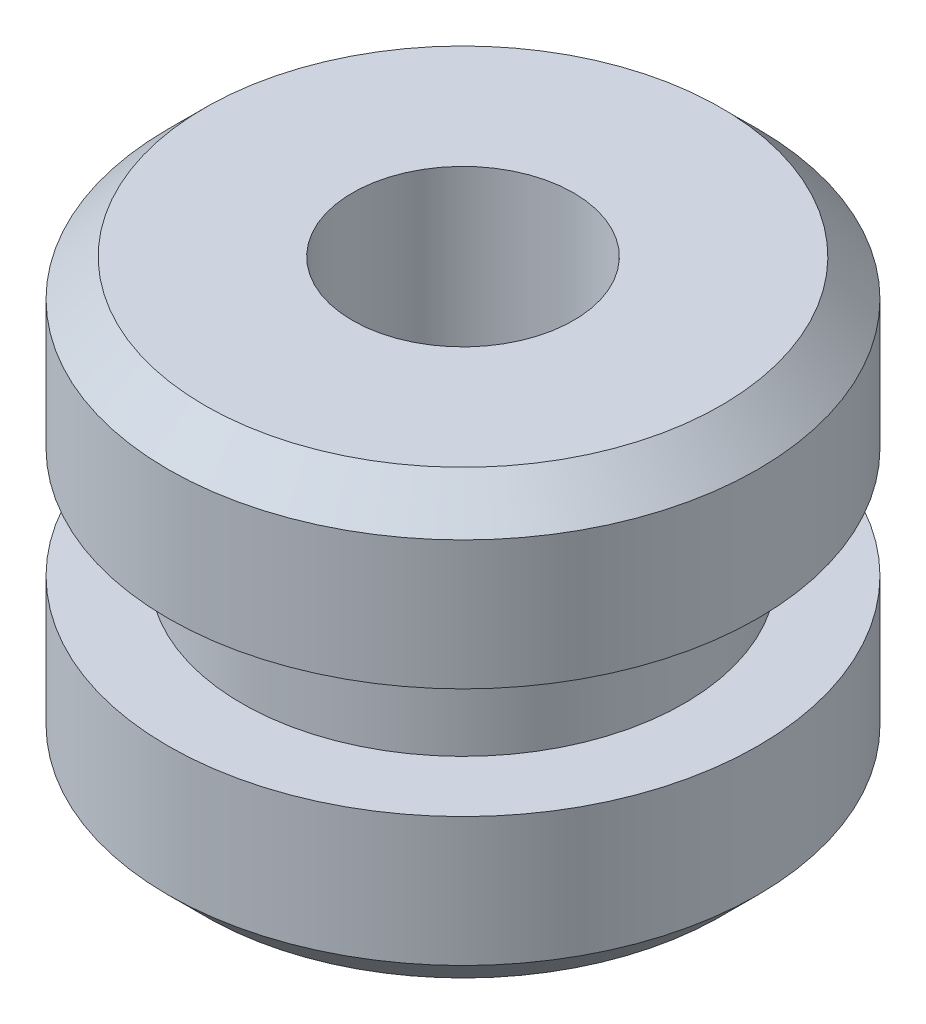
from build123d import *

# Parameters (mm, degrees)
CHANFREIN1_SIZE = 0.5


with BuildPart() as part:
    # Esquisse1 → Base-R_volution (revolve)
    with BuildSketch(Plane.XY, mode=Mode.PRIVATE) as base_r_volution_sk:
        Polygon((1.5, 6), (1.5, 0), (4, 0), (4, 2.25), (3, 2.25), (3, 3.75), (4, 3.75), (4, 6), align=None)
    revolve(base_r_volution_sk.sketch.rotate(Axis((0, -8, 0), (0, 1, 0)), 90), axis=Axis((0, -8, 0), (0, 1, 0)))

    # Chanfrein1
    chanfrein1_edges = [part.edges().sort_by_distance(p)[0] for p in [
        (0, 0, 4),
        (0, 6, 4),
    ]]
    chamfer(chanfrein1_edges, length=CHANFREIN1_SIZE)


solid = part.part
